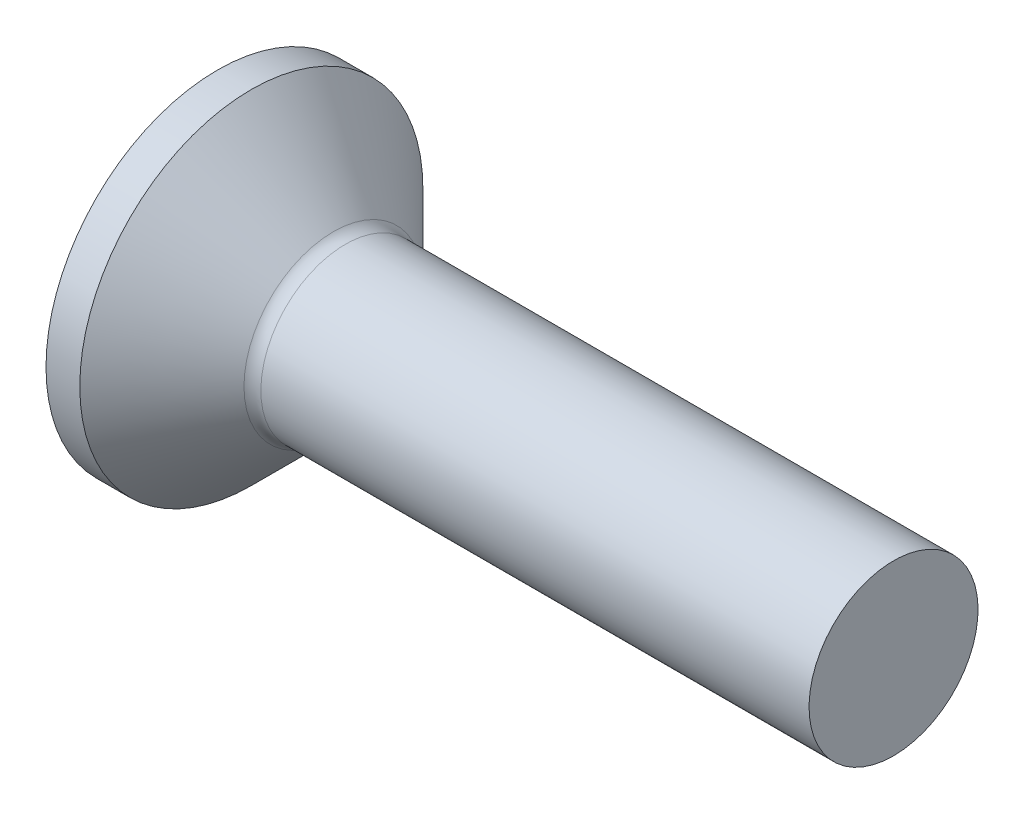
ISO-10303-21;
HEADER;
FILE_DESCRIPTION(('STEP AP214'),'2;1');
FILE_NAME('part.step','',(''),(''),'','','');
FILE_SCHEMA(('AUTOMOTIVE_DESIGN { 1 0 10303 214 1 1 1 1 }'));
ENDSEC;
DATA;
#1=APPLICATION_CONTEXT('core data for automotive mechanical design processes');
#2=APPLICATION_PROTOCOL_DEFINITION('international standard','automotive_design',2000,#1);
#3=PRODUCT_CONTEXT('',#1,'mechanical');
#4=PRODUCT('Part','Part','',(#3));
#5=PRODUCT_RELATED_PRODUCT_CATEGORY('part','',(#4));
#6=PRODUCT_DEFINITION_FORMATION('','',#4);
#7=PRODUCT_DEFINITION_CONTEXT('part definition',#1,'design');
#8=PRODUCT_DEFINITION('design','',#6,#7);
#9=PRODUCT_DEFINITION_SHAPE('','',#8);
#10=(LENGTH_UNIT() NAMED_UNIT(*) SI_UNIT(.MILLI.,.METRE.));
#11=(NAMED_UNIT(*) PLANE_ANGLE_UNIT() SI_UNIT($,.RADIAN.));
#12=(NAMED_UNIT(*) SI_UNIT($,.STERADIAN.) SOLID_ANGLE_UNIT());
#13=UNCERTAINTY_MEASURE_WITH_UNIT(LENGTH_MEASURE(1.E-05),#10,'distance_accuracy_value','');
#14=(GEOMETRIC_REPRESENTATION_CONTEXT(3) GLOBAL_UNCERTAINTY_ASSIGNED_CONTEXT((#13)) GLOBAL_UNIT_ASSIGNED_CONTEXT((#10,
#11,#12)) REPRESENTATION_CONTEXT('',''));
#15=CARTESIAN_POINT('',(0.,0.,0.));
#16=DIRECTION('',(0.,0.,1.));
#17=DIRECTION('',(1.,0.,0.));
#18=AXIS2_PLACEMENT_3D('',#15,#16,#17);
#19=CARTESIAN_POINT('',(0.,0.,0.));
#20=DIRECTION('',(1.,0.,0.));
#21=DIRECTION('',(0.,1.,0.));
#22=AXIS2_PLACEMENT_3D('',#19,#20,#21);
#23=PLANE('',#22);
#24=CARTESIAN_POINT('',(0.,0.,0.));
#25=DIRECTION('',(-1.,0.,0.));
#26=DIRECTION('',(0.,-1.,0.));
#27=AXIS2_PLACEMENT_3D('',#24,#25,#26);
#28=CIRCLE('',#27,1.015);
#29=CARTESIAN_POINT('',(0.,-1.015,0.));
#30=VERTEX_POINT('',#29);
#31=EDGE_CURVE('E48',#30,#30,#28,.T.);
#32=ORIENTED_EDGE('',*,*,#31,.T.);
#33=EDGE_LOOP('',(#32));
#34=FACE_BOUND('',#33,.T.);
#35=ADVANCED_FACE('F37',(#34),#23,.F.);
#36=CARTESIAN_POINT('',(-2.5225,0.,0.));
#37=DIRECTION('',(-1.,0.,0.));
#38=DIRECTION('',(0.,-1.,0.));
#39=AXIS2_PLACEMENT_3D('',#36,#37,#38);
#40=CYLINDRICAL_SURFACE('',#39,1.015);
#41=ORIENTED_EDGE('',*,*,#31,.F.);
#42=EDGE_LOOP('',(#41));
#43=FACE_BOUND('',#42,.T.);
#44=CARTESIAN_POINT('',(0.2,0.,0.));
#45=DIRECTION('',(-1.,0.,0.));
#46=DIRECTION('',(0.,-1.,0.));
#47=AXIS2_PLACEMENT_3D('',#44,#45,#46);
#48=CIRCLE('',#47,1.015);
#49=CARTESIAN_POINT('',(0.2,-1.015,0.));
#50=VERTEX_POINT('',#49);
#51=EDGE_CURVE('E52',#50,#50,#48,.T.);
#52=ORIENTED_EDGE('',*,*,#51,.T.);
#53=EDGE_LOOP('',(#52));
#54=FACE_BOUND('',#53,.T.);
#55=ADVANCED_FACE('F76',(#43,#54),#40,.T.);
#56=CARTESIAN_POINT('',(0.714999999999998,0.,0.));
#57=DIRECTION('',(-1.,0.,0.));
#58=DIRECTION('',(0.,-1.,0.));
#59=AXIS2_PLACEMENT_3D('',#56,#57,#58);
#60=CONICAL_SURFACE('',#59,0.5,0.78539816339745);
#61=CARTESIAN_POINT('',(0.685710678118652,0.,0.));
#62=DIRECTION('',(-1.,0.,0.));
#63=DIRECTION('',(0.,-1.,0.));
#64=AXIS2_PLACEMENT_3D('',#61,#62,#63);
#65=CIRCLE('',#64,0.529289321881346);
#66=CARTESIAN_POINT('',(0.685710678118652,-0.529289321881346,0.));
#67=VERTEX_POINT('',#66);
#68=EDGE_CURVE('E44',#67,#67,#65,.T.);
#69=ORIENTED_EDGE('',*,*,#68,.T.);
#70=EDGE_LOOP('',(#69));
#71=FACE_BOUND('',#70,.T.);
#72=ORIENTED_EDGE('',*,*,#51,.F.);
#73=EDGE_LOOP('',(#72));
#74=FACE_BOUND('',#73,.T.);
#75=ADVANCED_FACE('F73',(#71,#74),#60,.T.);
#76=CARTESIAN_POINT('',(-2.5225,0.,0.));
#77=DIRECTION('',(-1.,0.,0.));
#78=DIRECTION('',(0.,-1.,0.));
#79=AXIS2_PLACEMENT_3D('',#76,#77,#78);
#80=CYLINDRICAL_SURFACE('',#79,0.5);
#81=CARTESIAN_POINT('',(0.756421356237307,0.,0.));
#82=DIRECTION('',(-1.,0.,0.));
#83=DIRECTION('',(0.,-1.,0.));
#84=AXIS2_PLACEMENT_3D('',#81,#82,#83);
#85=CIRCLE('',#84,0.5);
#86=CARTESIAN_POINT('',(0.756421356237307,-0.5,0.));
#87=VERTEX_POINT('',#86);
#88=EDGE_CURVE('E10',#87,#87,#85,.F.);
#89=ORIENTED_EDGE('',*,*,#88,.T.);
#90=EDGE_LOOP('',(#89));
#91=FACE_BOUND('',#90,.T.);
#92=CARTESIAN_POINT('',(4.,0.,0.));
#93=DIRECTION('',(-1.,0.,0.));
#94=DIRECTION('',(0.,-1.,0.));
#95=AXIS2_PLACEMENT_3D('',#92,#93,#94);
#96=CIRCLE('',#95,0.5);
#97=CARTESIAN_POINT('',(4.,-0.5,0.));
#98=VERTEX_POINT('',#97);
#99=EDGE_CURVE('E57',#98,#98,#96,.T.);
#100=ORIENTED_EDGE('',*,*,#99,.T.);
#101=EDGE_LOOP('',(#100));
#102=FACE_BOUND('',#101,.T.);
#103=ADVANCED_FACE('F61',(#91,#102),#80,.T.);
#104=CARTESIAN_POINT('',(4.,0.500000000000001,0.));
#105=DIRECTION('',(-1.,0.,0.));
#106=DIRECTION('',(0.,-1.,0.));
#107=AXIS2_PLACEMENT_3D('',#104,#105,#106);
#108=PLANE('',#107);
#109=ORIENTED_EDGE('',*,*,#99,.F.);
#110=EDGE_LOOP('',(#109));
#111=FACE_BOUND('',#110,.T.);
#112=ADVANCED_FACE('F63',(#111),#108,.F.);
#113=CARTESIAN_POINT('',(0.756421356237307,0.,0.));
#114=DIRECTION('',(-1.,0.,0.));
#115=DIRECTION('',(0.,-1.,0.));
#116=AXIS2_PLACEMENT_3D('',#113,#114,#115);
#117=TOROIDAL_SURFACE('',#116,0.6,0.1);
#118=ORIENTED_EDGE('',*,*,#88,.F.);
#119=EDGE_LOOP('',(#118));
#120=FACE_BOUND('',#119,.T.);
#121=ORIENTED_EDGE('',*,*,#68,.F.);
#122=EDGE_LOOP('',(#121));
#123=FACE_BOUND('',#122,.T.);
#124=ADVANCED_FACE('F39',(#120,#123),#117,.F.);
#125=CLOSED_SHELL('',(#35,#55,#75,#103,#112,#124));
#126=MANIFOLD_SOLID_BREP('B2',#125);
#127=ADVANCED_BREP_SHAPE_REPRESENTATION('',(#18,#126),#14);
#128=SHAPE_DEFINITION_REPRESENTATION(#9,#127);
ENDSEC;
END-ISO-10303-21;
